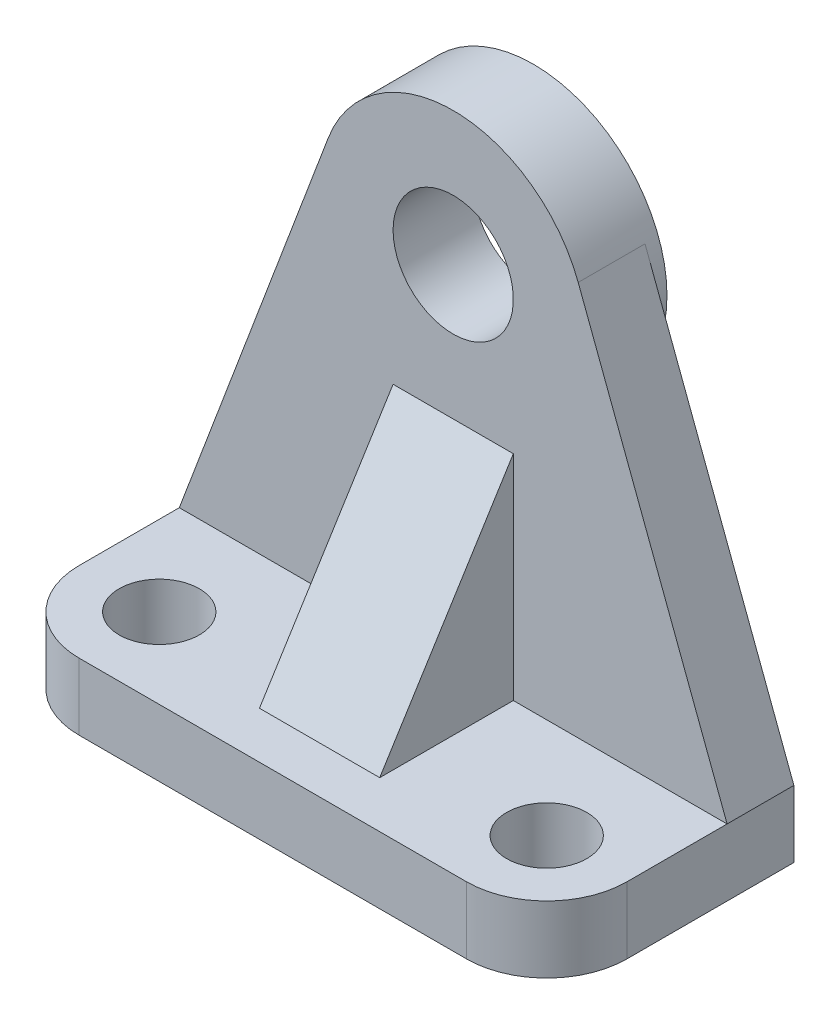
from build123d import *

# Parameters (mm, degrees)
SKETCH1_R           = 6
BOSS_EXTRUDE1_DEPTH = 10
BOSS_EXTRUDE2_DEPTH = 10
BOSS_EXTRUDE3_START = 2
SKETCH3_R           = 20
BOSS_EXTRUDE3_DEPTH = 2
SKETCH4_R           = 9
CUT_EXTRUDE1_DEPTH  = 100.629312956
RIB1_REACH          = 95.943
SKETCH5_WALL_W      = 227.621528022
SKETCH5_WALL_H      = 18


with BuildPart() as part:
    # Sketch1 → Boss-Extrude1 (new body)
    with BuildSketch(Plane(origin=(0, 0, 0), x_dir=(1, 0, 0), z_dir=(0, 1, 0))):
        with BuildLine():
            Line((-41, 18.5), (41, 18.5))
            Line((41, 18.5), (41, -6.5))
            ThreePointArc((41, -6.5), (37.485281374, -14.985281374), (29, -18.5))
            Line((29, -18.5), (-29, -18.5))
            ThreePointArc((-29, -18.5), (-37.485281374, -14.985281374), (-41, -6.5))
            Line((-41, -6.5), (-41, 18.5))
        make_face()
        with Locations(Location((-29, -6.5, 0), (0, 0, 270))):
            Circle(SKETCH1_R, mode=Mode.SUBTRACT)
        with Locations(Location((29, -6.5, 0), (0, 0, 270))):
            Circle(SKETCH1_R, mode=Mode.SUBTRACT)
    extrude(amount=BOSS_EXTRUDE1_DEPTH)

    # Sketch2 → Boss-Extrude2 (add)
    with BuildSketch(Plane(origin=(0, 0, -18.5), x_dir=(-1, 0, 0), z_dir=(0, 0, -1))):
        with BuildLine():
            Line((-18.711956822, 69.061350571), (-41, 10))
            Line((-41, 10), (41, 10))
            Line((41, 10), (18.711956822, 69.061350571))
            ThreePointArc((18.711956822, 69.061350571), (0, 82), (-18.711956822, 69.061350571))
        make_face()
    extrude(amount=-BOSS_EXTRUDE2_DEPTH)

    # Sketch3 → Boss-Extrude3 (add)
    with BuildSketch(Plane(origin=(0, 0, -18.5), x_dir=(-1, 0, 0), z_dir=(0, 0, -1)).offset(BOSS_EXTRUDE3_START)):
        with Locations((0, 62)):
            Circle(SKETCH3_R)
    extrude(amount=-BOSS_EXTRUDE3_DEPTH)

    # Sketch4 → Cut-Extrude1 (cut, through all)
    with BuildSketch(Plane(origin=(0, 0, -20.5), x_dir=(-1, 0, 0), z_dir=(0, 0, -1))):
        with Locations((0, 62)):
            Circle(SKETCH4_R)
    extrude(amount=-CUT_EXTRUDE1_DEPTH, mode=Mode.SUBTRACT)

    # Sketch5 wall → Rib1 (add, up to next)
    with BuildSketch(Plane(origin=(0, 26, 1.5), x_dir=(0, 0.847998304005, -0.529998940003), z_dir=(0, 0.529998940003, 0.847998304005)), mode=Mode.PRIVATE) as rib1_sk1:
        Rectangle(SKETCH5_WALL_W, SKETCH5_WALL_H)
    rib1_tool1 = extrude(rib1_sk1.sketch, amount=-RIB1_REACH, mode=Mode.PRIVATE) - part.part
    add(rib1_tool1.solids().sort_by_distance((0, 26, 1.5))[0])


solid = part.part
